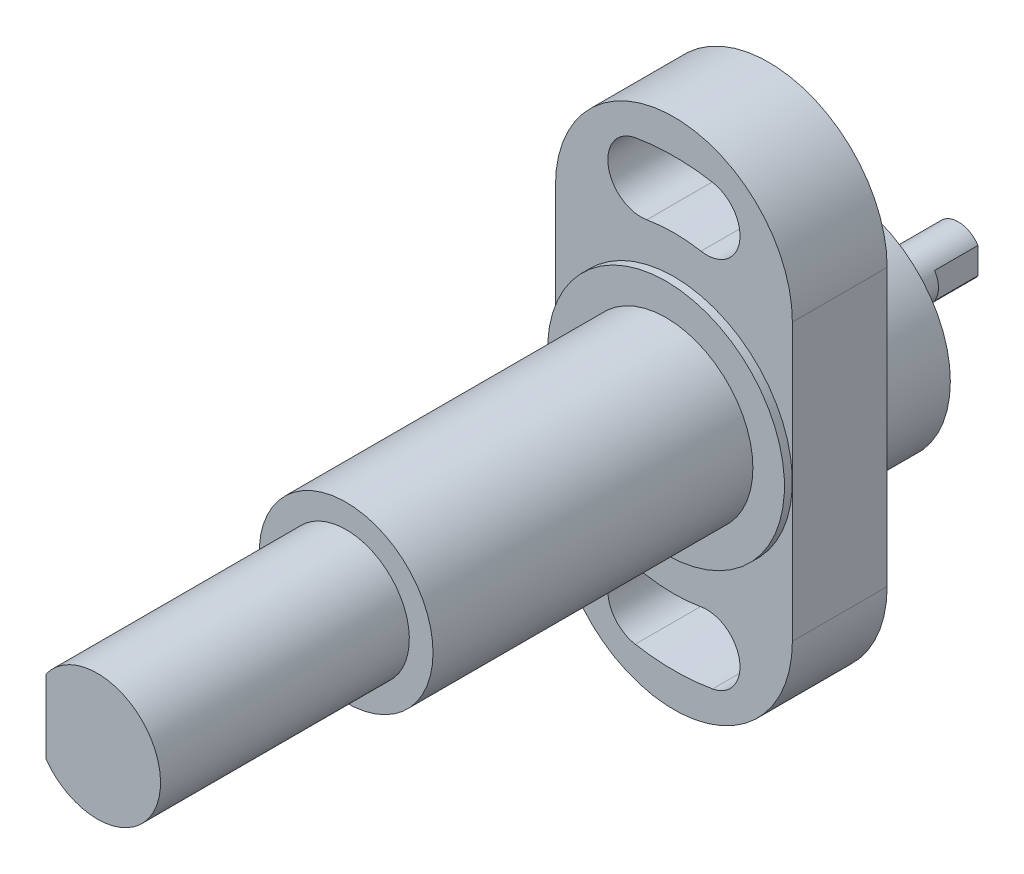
ISO-10303-21;
HEADER;
FILE_DESCRIPTION(('STEP AP214'),'2;1');
FILE_NAME('part.step','',(''),(''),'','','');
FILE_SCHEMA(('AUTOMOTIVE_DESIGN { 1 0 10303 214 1 1 1 1 }'));
ENDSEC;
DATA;
#1=APPLICATION_CONTEXT('core data for automotive mechanical design processes');
#2=APPLICATION_PROTOCOL_DEFINITION('international standard','automotive_design',2000,#1);
#3=PRODUCT_CONTEXT('',#1,'mechanical');
#4=PRODUCT('Part','Part','',(#3));
#5=PRODUCT_RELATED_PRODUCT_CATEGORY('part','',(#4));
#6=PRODUCT_DEFINITION_FORMATION('','',#4);
#7=PRODUCT_DEFINITION_CONTEXT('part definition',#1,'design');
#8=PRODUCT_DEFINITION('design','',#6,#7);
#9=PRODUCT_DEFINITION_SHAPE('','',#8);
#10=(LENGTH_UNIT() NAMED_UNIT(*) SI_UNIT(.MILLI.,.METRE.));
#11=(NAMED_UNIT(*) PLANE_ANGLE_UNIT() SI_UNIT($,.RADIAN.));
#12=(NAMED_UNIT(*) SI_UNIT($,.STERADIAN.) SOLID_ANGLE_UNIT());
#13=UNCERTAINTY_MEASURE_WITH_UNIT(LENGTH_MEASURE(1.E-05),#10,'distance_accuracy_value','');
#14=(GEOMETRIC_REPRESENTATION_CONTEXT(3) GLOBAL_UNCERTAINTY_ASSIGNED_CONTEXT((#13)) GLOBAL_UNIT_ASSIGNED_CONTEXT((#10,
#11,#12)) REPRESENTATION_CONTEXT('',''));
#15=CARTESIAN_POINT('',(0.,0.,0.));
#16=DIRECTION('',(0.,0.,1.));
#17=DIRECTION('',(1.,0.,0.));
#18=AXIS2_PLACEMENT_3D('',#15,#16,#17);
#19=CARTESIAN_POINT('',(-8.,0.,-21.));
#20=DIRECTION('',(0.,0.,-1.));
#21=DIRECTION('',(0.,-1.,0.));
#22=AXIS2_PLACEMENT_3D('',#19,#20,#21);
#23=PLANE('',#22);
#24=CARTESIAN_POINT('',(0.,0.,-21.));
#25=DIRECTION('',(0.,0.,-1.));
#26=DIRECTION('',(0.,-1.,0.));
#27=AXIS2_PLACEMENT_3D('',#24,#25,#26);
#28=CIRCLE('',#27,14.);
#29=CARTESIAN_POINT('',(0.,-14.,-21.));
#30=VERTEX_POINT('',#29);
#31=EDGE_CURVE('E254',#30,#30,#28,.T.);
#32=ORIENTED_EDGE('',*,*,#31,.T.);
#33=EDGE_LOOP('',(#32));
#34=FACE_BOUND('',#33,.T.);
#35=CARTESIAN_POINT('',(0.,0.,-21.));
#36=DIRECTION('',(0.,0.,-1.));
#37=DIRECTION('',(-1.,0.,0.));
#38=AXIS2_PLACEMENT_3D('',#35,#36,#37);
#39=CIRCLE('',#38,3.);
#40=CARTESIAN_POINT('',(-3.,0.,-21.));
#41=VERTEX_POINT('',#40);
#42=EDGE_CURVE('E183',#41,#41,#39,.T.);
#43=ORIENTED_EDGE('',*,*,#42,.F.);
#44=EDGE_LOOP('',(#43));
#45=FACE_BOUND('',#44,.T.);
#46=ADVANCED_FACE('F14',(#34,#45),#23,.T.);
#47=CARTESIAN_POINT('',(0.,0.,-21.));
#48=DIRECTION('',(0.,0.,1.));
#49=DIRECTION('',(0.,1.,0.));
#50=AXIS2_PLACEMENT_3D('',#47,#48,#49);
#51=CYLINDRICAL_SURFACE('',#50,28.2);
#52=DIRECTION('',(0.,0.,1.));
#53=VECTOR('',#52,1.);
#54=CARTESIAN_POINT('',(4.89687861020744,-27.7715786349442,-21.));
#55=LINE('',#54,#53);
#56=CARTESIAN_POINT('',(4.89687861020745,-27.7715786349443,-12.));
#57=VERTEX_POINT('',#56);
#58=CARTESIAN_POINT('',(4.89687861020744,-27.7715786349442,0.));
#59=VERTEX_POINT('',#58);
#60=EDGE_CURVE('E252',#57,#59,#55,.T.);
#61=ORIENTED_EDGE('',*,*,#60,.F.);
#62=CARTESIAN_POINT('',(0.,0.,-12.));
#63=DIRECTION('',(0.,0.,-1.));
#64=DIRECTION('',(-1.,0.,0.));
#65=AXIS2_PLACEMENT_3D('',#62,#63,#64);
#66=CIRCLE('',#65,28.2);
#67=CARTESIAN_POINT('',(-4.89687861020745,-27.7715786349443,-12.));
#68=VERTEX_POINT('',#67);
#69=EDGE_CURVE('E189',#57,#68,#66,.T.);
#70=ORIENTED_EDGE('',*,*,#69,.T.);
#71=DIRECTION('',(0.,0.,1.));
#72=VECTOR('',#71,1.);
#73=CARTESIAN_POINT('',(-4.89687861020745,-27.7715786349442,-21.));
#74=LINE('',#73,#72);
#75=CARTESIAN_POINT('',(-4.89687861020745,-27.7715786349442,0.));
#76=VERTEX_POINT('',#75);
#77=EDGE_CURVE('E255',#68,#76,#74,.T.);
#78=ORIENTED_EDGE('',*,*,#77,.T.);
#79=CARTESIAN_POINT('',(0.,0.,0.));
#80=DIRECTION('',(0.,0.,-1.));
#81=DIRECTION('',(0.,-1.,0.));
#82=AXIS2_PLACEMENT_3D('',#79,#80,#81);
#83=CIRCLE('',#82,28.2);
#84=EDGE_CURVE('E319',#59,#76,#83,.T.);
#85=ORIENTED_EDGE('',*,*,#84,.F.);
#86=EDGE_LOOP('',(#61,#70,#78,#85));
#87=FACE_BOUND('',#86,.T.);
#88=ADVANCED_FACE('F373',(#87),#51,.F.);
#89=CARTESIAN_POINT('',(-4.16755626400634,-23.635386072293,-21.));
#90=DIRECTION('',(0.,0.,1.));
#91=DIRECTION('',(0.,1.,0.));
#92=AXIS2_PLACEMENT_3D('',#89,#90,#91);
#93=CYLINDRICAL_SURFACE('',#92,4.2);
#94=ORIENTED_EDGE('',*,*,#77,.F.);
#95=CARTESIAN_POINT('',(-4.16755626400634,-23.635386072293,-12.));
#96=DIRECTION('',(0.,0.,-1.));
#97=DIRECTION('',(-1.,0.,0.));
#98=AXIS2_PLACEMENT_3D('',#95,#96,#97);
#99=CIRCLE('',#98,4.2);
#100=CARTESIAN_POINT('',(-3.43823391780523,-19.4991935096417,-12.));
#101=VERTEX_POINT('',#100);
#102=EDGE_CURVE('E194',#68,#101,#99,.T.);
#103=ORIENTED_EDGE('',*,*,#102,.T.);
#104=DIRECTION('',(0.,0.,1.));
#105=VECTOR('',#104,1.);
#106=CARTESIAN_POINT('',(-3.43823391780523,-19.4991935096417,-21.));
#107=LINE('',#106,#105);
#108=CARTESIAN_POINT('',(-3.43823391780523,-19.4991935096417,0.));
#109=VERTEX_POINT('',#108);
#110=EDGE_CURVE('E257',#101,#109,#107,.T.);
#111=ORIENTED_EDGE('',*,*,#110,.T.);
#112=CARTESIAN_POINT('',(-4.16755626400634,-23.635386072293,0.));
#113=DIRECTION('',(0.,0.,-1.));
#114=DIRECTION('',(0.,-1.,0.));
#115=AXIS2_PLACEMENT_3D('',#112,#113,#114);
#116=CIRCLE('',#115,4.2);
#117=EDGE_CURVE('E316',#76,#109,#116,.T.);
#118=ORIENTED_EDGE('',*,*,#117,.F.);
#119=EDGE_LOOP('',(#94,#103,#111,#118));
#120=FACE_BOUND('',#119,.T.);
#121=ADVANCED_FACE('F380',(#120),#93,.F.);
#122=CARTESIAN_POINT('',(0.,0.,-21.));
#123=DIRECTION('',(0.,0.,1.));
#124=DIRECTION('',(0.,1.,0.));
#125=AXIS2_PLACEMENT_3D('',#122,#123,#124);
#126=CYLINDRICAL_SURFACE('',#125,19.8);
#127=ORIENTED_EDGE('',*,*,#110,.F.);
#128=CARTESIAN_POINT('',(0.,0.,-12.));
#129=DIRECTION('',(0.,0.,1.));
#130=DIRECTION('',(-1.,0.,0.));
#131=AXIS2_PLACEMENT_3D('',#128,#129,#130);
#132=CIRCLE('',#131,19.8);
#133=CARTESIAN_POINT('',(3.43823391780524,-19.4991935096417,-12.));
#134=VERTEX_POINT('',#133);
#135=EDGE_CURVE('E197',#101,#134,#132,.T.);
#136=ORIENTED_EDGE('',*,*,#135,.T.);
#137=DIRECTION('',(0.,0.,1.));
#138=VECTOR('',#137,1.);
#139=CARTESIAN_POINT('',(3.43823391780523,-19.4991935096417,-21.));
#140=LINE('',#139,#138);
#141=CARTESIAN_POINT('',(3.43823391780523,-19.4991935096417,0.));
#142=VERTEX_POINT('',#141);
#143=EDGE_CURVE('E246',#134,#142,#140,.T.);
#144=ORIENTED_EDGE('',*,*,#143,.T.);
#145=CARTESIAN_POINT('',(0.,0.,0.));
#146=DIRECTION('',(0.,0.,-1.));
#147=DIRECTION('',(0.,-1.,0.));
#148=AXIS2_PLACEMENT_3D('',#145,#146,#147);
#149=CIRCLE('',#148,19.8);
#150=EDGE_CURVE('E313',#109,#142,#149,.F.);
#151=ORIENTED_EDGE('',*,*,#150,.F.);
#152=EDGE_LOOP('',(#127,#136,#144,#151));
#153=FACE_BOUND('',#152,.T.);
#154=ADVANCED_FACE('F541',(#153),#126,.T.);
#155=CARTESIAN_POINT('',(4.16755626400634,-23.635386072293,-21.));
#156=DIRECTION('',(0.,0.,1.));
#157=DIRECTION('',(0.,1.,0.));
#158=AXIS2_PLACEMENT_3D('',#155,#156,#157);
#159=CYLINDRICAL_SURFACE('',#158,4.2);
#160=ORIENTED_EDGE('',*,*,#143,.F.);
#161=CARTESIAN_POINT('',(4.16755626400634,-23.635386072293,-12.));
#162=DIRECTION('',(0.,0.,-1.));
#163=DIRECTION('',(-1.,0.,0.));
#164=AXIS2_PLACEMENT_3D('',#161,#162,#163);
#165=CIRCLE('',#164,4.2);
#166=EDGE_CURVE('E200',#134,#57,#165,.T.);
#167=ORIENTED_EDGE('',*,*,#166,.T.);
#168=ORIENTED_EDGE('',*,*,#60,.T.);
#169=CARTESIAN_POINT('',(4.16755626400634,-23.635386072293,0.));
#170=DIRECTION('',(0.,0.,-1.));
#171=DIRECTION('',(0.,-1.,0.));
#172=AXIS2_PLACEMENT_3D('',#169,#170,#171);
#173=CIRCLE('',#172,4.2);
#174=EDGE_CURVE('E322',#142,#59,#173,.T.);
#175=ORIENTED_EDGE('',*,*,#174,.F.);
#176=EDGE_LOOP('',(#160,#167,#168,#175));
#177=FACE_BOUND('',#176,.T.);
#178=ADVANCED_FACE('F527',(#177),#159,.F.);
#179=CARTESIAN_POINT('',(0.,0.,-21.));
#180=DIRECTION('',(0.,0.,1.));
#181=DIRECTION('',(0.,1.,0.));
#182=AXIS2_PLACEMENT_3D('',#179,#180,#181);
#183=CYLINDRICAL_SURFACE('',#182,28.2);
#184=DIRECTION('',(0.,0.,1.));
#185=VECTOR('',#184,1.);
#186=CARTESIAN_POINT('',(-4.89687861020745,27.7715786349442,-21.));
#187=LINE('',#186,#185);
#188=CARTESIAN_POINT('',(-4.89687861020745,27.7715786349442,-12.));
#189=VERTEX_POINT('',#188);
#190=CARTESIAN_POINT('',(-4.89687861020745,27.7715786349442,0.));
#191=VERTEX_POINT('',#190);
#192=EDGE_CURVE('E244',#189,#191,#187,.T.);
#193=ORIENTED_EDGE('',*,*,#192,.F.);
#194=CARTESIAN_POINT('',(0.,0.,-12.));
#195=DIRECTION('',(0.,0.,-1.));
#196=DIRECTION('',(-1.,0.,0.));
#197=AXIS2_PLACEMENT_3D('',#194,#195,#196);
#198=CIRCLE('',#197,28.2);
#199=CARTESIAN_POINT('',(4.89687861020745,27.7715786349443,-12.));
#200=VERTEX_POINT('',#199);
#201=EDGE_CURVE('E206',#189,#200,#198,.T.);
#202=ORIENTED_EDGE('',*,*,#201,.T.);
#203=DIRECTION('',(0.,0.,1.));
#204=VECTOR('',#203,1.);
#205=CARTESIAN_POINT('',(4.89687861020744,27.7715786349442,-21.));
#206=LINE('',#205,#204);
#207=CARTESIAN_POINT('',(4.89687861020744,27.7715786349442,0.));
#208=VERTEX_POINT('',#207);
#209=EDGE_CURVE('E247',#200,#208,#206,.T.);
#210=ORIENTED_EDGE('',*,*,#209,.T.);
#211=CARTESIAN_POINT('',(0.,0.,0.));
#212=DIRECTION('',(0.,0.,-1.));
#213=DIRECTION('',(0.,-1.,0.));
#214=AXIS2_PLACEMENT_3D('',#211,#212,#213);
#215=CIRCLE('',#214,28.2);
#216=EDGE_CURVE('E23',#191,#208,#215,.T.);
#217=ORIENTED_EDGE('',*,*,#216,.F.);
#218=EDGE_LOOP('',(#193,#202,#210,#217));
#219=FACE_BOUND('',#218,.T.);
#220=ADVANCED_FACE('F523',(#219),#183,.F.);
#221=CARTESIAN_POINT('',(4.16755626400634,23.635386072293,-21.));
#222=DIRECTION('',(0.,0.,1.));
#223=DIRECTION('',(0.,1.,0.));
#224=AXIS2_PLACEMENT_3D('',#221,#222,#223);
#225=CYLINDRICAL_SURFACE('',#224,4.2);
#226=ORIENTED_EDGE('',*,*,#209,.F.);
#227=CARTESIAN_POINT('',(4.16755626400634,23.635386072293,-12.));
#228=DIRECTION('',(0.,0.,-1.));
#229=DIRECTION('',(-1.,0.,0.));
#230=AXIS2_PLACEMENT_3D('',#227,#228,#229);
#231=CIRCLE('',#230,4.2);
#232=CARTESIAN_POINT('',(3.43823391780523,19.4991935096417,-12.));
#233=VERTEX_POINT('',#232);
#234=EDGE_CURVE('E209',#200,#233,#231,.T.);
#235=ORIENTED_EDGE('',*,*,#234,.T.);
#236=DIRECTION('',(0.,0.,1.));
#237=VECTOR('',#236,1.);
#238=CARTESIAN_POINT('',(3.43823391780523,19.4991935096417,-21.));
#239=LINE('',#238,#237);
#240=CARTESIAN_POINT('',(3.43823391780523,19.4991935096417,0.));
#241=VERTEX_POINT('',#240);
#242=EDGE_CURVE('E249',#233,#241,#239,.T.);
#243=ORIENTED_EDGE('',*,*,#242,.T.);
#244=CARTESIAN_POINT('',(4.16755626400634,23.635386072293,0.));
#245=DIRECTION('',(0.,0.,-1.));
#246=DIRECTION('',(0.,-1.,0.));
#247=AXIS2_PLACEMENT_3D('',#244,#245,#246);
#248=CIRCLE('',#247,4.2);
#249=EDGE_CURVE('E328',#208,#241,#248,.T.);
#250=ORIENTED_EDGE('',*,*,#249,.F.);
#251=EDGE_LOOP('',(#226,#235,#243,#250));
#252=FACE_BOUND('',#251,.T.);
#253=ADVANCED_FACE('F526',(#252),#225,.F.);
#254=CARTESIAN_POINT('',(0.,0.,-21.));
#255=DIRECTION('',(0.,0.,1.));
#256=DIRECTION('',(0.,1.,0.));
#257=AXIS2_PLACEMENT_3D('',#254,#255,#256);
#258=CYLINDRICAL_SURFACE('',#257,19.8);
#259=ORIENTED_EDGE('',*,*,#242,.F.);
#260=CARTESIAN_POINT('',(0.,0.,-12.));
#261=DIRECTION('',(0.,0.,1.));
#262=DIRECTION('',(-1.,0.,0.));
#263=AXIS2_PLACEMENT_3D('',#260,#261,#262);
#264=CIRCLE('',#263,19.8);
#265=CARTESIAN_POINT('',(-3.43823391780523,19.4991935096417,-12.));
#266=VERTEX_POINT('',#265);
#267=EDGE_CURVE('E212',#233,#266,#264,.T.);
#268=ORIENTED_EDGE('',*,*,#267,.T.);
#269=DIRECTION('',(0.,0.,1.));
#270=VECTOR('',#269,1.);
#271=CARTESIAN_POINT('',(-3.43823391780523,19.4991935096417,-21.));
#272=LINE('',#271,#270);
#273=CARTESIAN_POINT('',(-3.43823391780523,19.4991935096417,0.));
#274=VERTEX_POINT('',#273);
#275=EDGE_CURVE('E243',#266,#274,#272,.T.);
#276=ORIENTED_EDGE('',*,*,#275,.T.);
#277=CARTESIAN_POINT('',(0.,0.,0.));
#278=DIRECTION('',(0.,0.,-1.));
#279=DIRECTION('',(0.,-1.,0.));
#280=AXIS2_PLACEMENT_3D('',#277,#278,#279);
#281=CIRCLE('',#280,19.8);
#282=EDGE_CURVE('E325',#241,#274,#281,.F.);
#283=ORIENTED_EDGE('',*,*,#282,.F.);
#284=EDGE_LOOP('',(#259,#268,#276,#283));
#285=FACE_BOUND('',#284,.T.);
#286=ADVANCED_FACE('F531',(#285),#258,.T.);
#287=CARTESIAN_POINT('',(-4.16755626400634,23.635386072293,-21.));
#288=DIRECTION('',(0.,0.,1.));
#289=DIRECTION('',(0.,1.,0.));
#290=AXIS2_PLACEMENT_3D('',#287,#288,#289);
#291=CYLINDRICAL_SURFACE('',#290,4.2);
#292=ORIENTED_EDGE('',*,*,#275,.F.);
#293=CARTESIAN_POINT('',(-4.16755626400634,23.635386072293,-12.));
#294=DIRECTION('',(0.,0.,-1.));
#295=DIRECTION('',(-1.,0.,0.));
#296=AXIS2_PLACEMENT_3D('',#293,#294,#295);
#297=CIRCLE('',#296,4.2);
#298=EDGE_CURVE('E203',#266,#189,#297,.T.);
#299=ORIENTED_EDGE('',*,*,#298,.T.);
#300=ORIENTED_EDGE('',*,*,#192,.T.);
#301=CARTESIAN_POINT('',(-4.16755626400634,23.635386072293,0.));
#302=DIRECTION('',(0.,0.,-1.));
#303=DIRECTION('',(0.,-1.,0.));
#304=AXIS2_PLACEMENT_3D('',#301,#302,#303);
#305=CIRCLE('',#304,4.2);
#306=EDGE_CURVE('E9',#274,#191,#305,.T.);
#307=ORIENTED_EDGE('',*,*,#306,.F.);
#308=EDGE_LOOP('',(#292,#299,#300,#307));
#309=FACE_BOUND('',#308,.T.);
#310=ADVANCED_FACE('F448',(#309),#291,.F.);
#311=CARTESIAN_POINT('',(-11.,0.,1.));
#312=DIRECTION('',(0.,0.,1.));
#313=DIRECTION('',(0.,1.,0.));
#314=AXIS2_PLACEMENT_3D('',#311,#312,#313);
#315=PLANE('',#314);
#316=CARTESIAN_POINT('',(0.,0.,1.));
#317=DIRECTION('',(0.,0.,1.));
#318=DIRECTION('',(0.,1.,0.));
#319=AXIS2_PLACEMENT_3D('',#316,#317,#318);
#320=CIRCLE('',#319,11.);
#321=CARTESIAN_POINT('',(0.,11.,1.));
#322=VERTEX_POINT('',#321);
#323=EDGE_CURVE('E299',#322,#322,#320,.F.);
#324=ORIENTED_EDGE('',*,*,#323,.T.);
#325=EDGE_LOOP('',(#324));
#326=FACE_BOUND('',#325,.T.);
#327=CARTESIAN_POINT('',(0.,0.,1.));
#328=DIRECTION('',(0.,0.,-1.));
#329=DIRECTION('',(0.,-1.,0.));
#330=AXIS2_PLACEMENT_3D('',#327,#328,#329);
#331=CIRCLE('',#330,14.995);
#332=CARTESIAN_POINT('',(0.,-14.995,1.));
#333=VERTEX_POINT('',#332);
#334=EDGE_CURVE('E296',#333,#333,#331,.T.);
#335=ORIENTED_EDGE('',*,*,#334,.F.);
#336=EDGE_LOOP('',(#335));
#337=FACE_BOUND('',#336,.T.);
#338=ADVANCED_FACE('F445',(#326,#337),#315,.T.);
#339=CARTESIAN_POINT('',(-15.,10.,-6.));
#340=DIRECTION('',(-1.,0.,0.));
#341=DIRECTION('',(0.,-1.,0.));
#342=AXIS2_PLACEMENT_3D('',#339,#340,#341);
#343=CONICAL_SURFACE('',#342,2.65,0.78539816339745);
#344=CARTESIAN_POINT('',(-14.85,10.,-6.));
#345=DIRECTION('',(-1.,0.,0.));
#346=DIRECTION('',(0.,0.,1.));
#347=AXIS2_PLACEMENT_3D('',#344,#345,#346);
#348=CIRCLE('',#347,2.5);
#349=CARTESIAN_POINT('',(-14.85,10.,-3.5));
#350=VERTEX_POINT('',#349);
#351=EDGE_CURVE('E341',#350,#350,#348,.F.);
#352=ORIENTED_EDGE('',*,*,#351,.T.);
#353=EDGE_LOOP('',(#352));
#354=FACE_BOUND('',#353,.T.);
#355=CARTESIAN_POINT('',(-15.,10.,-6.));
#356=DIRECTION('',(-1.,0.,0.));
#357=DIRECTION('',(0.,-1.,0.));
#358=AXIS2_PLACEMENT_3D('',#355,#356,#357);
#359=CIRCLE('',#358,2.65);
#360=CARTESIAN_POINT('',(-15.,7.35,-6.));
#361=VERTEX_POINT('',#360);
#362=EDGE_CURVE('E233',#361,#361,#359,.T.);
#363=ORIENTED_EDGE('',*,*,#362,.T.);
#364=EDGE_LOOP('',(#363));
#365=FACE_BOUND('',#364,.T.);
#366=ADVANCED_FACE('F443',(#354,#365),#343,.F.);
#367=CARTESIAN_POINT('',(0.,0.,-12.));
#368=DIRECTION('',(0.,0.,-1.));
#369=DIRECTION('',(0.,-1.,0.));
#370=AXIS2_PLACEMENT_3D('',#367,#368,#369);
#371=CYLINDRICAL_SURFACE('',#370,14.995);
#372=ORIENTED_EDGE('',*,*,#334,.T.);
#373=EDGE_LOOP('',(#372));
#374=FACE_BOUND('',#373,.T.);
#375=CARTESIAN_POINT('',(0.,0.,0.));
#376=DIRECTION('',(0.,0.,1.));
#377=DIRECTION('',(0.,1.,0.));
#378=AXIS2_PLACEMENT_3D('',#375,#376,#377);
#379=CIRCLE('',#378,14.995);
#380=CARTESIAN_POINT('',(0.,14.995,0.));
#381=VERTEX_POINT('',#380);
#382=EDGE_CURVE('E276',#381,#381,#379,.T.);
#383=ORIENTED_EDGE('',*,*,#382,.T.);
#384=EDGE_LOOP('',(#383));
#385=FACE_BOUND('',#384,.T.);
#386=ADVANCED_FACE('F429',(#374,#385),#371,.T.);
#387=CARTESIAN_POINT('',(15.,-17.5,0.));
#388=DIRECTION('',(-1.,0.,0.));
#389=DIRECTION('',(0.,-1.,0.));
#390=AXIS2_PLACEMENT_3D('',#387,#388,#389);
#391=PLANE('',#390);
#392=DIRECTION('',(0.,-1.,0.));
#393=VECTOR('',#392,1.);
#394=CARTESIAN_POINT('',(15.,17.5,-12.));
#395=LINE('',#394,#393);
#396=CARTESIAN_POINT('',(15.,17.5,-12.));
#397=VERTEX_POINT('',#396);
#398=CARTESIAN_POINT('',(15.,-17.5,-12.));
#399=VERTEX_POINT('',#398);
#400=EDGE_CURVE('E221',#397,#399,#395,.T.);
#401=ORIENTED_EDGE('',*,*,#400,.F.);
#402=DIRECTION('',(0.,0.,-1.));
#403=VECTOR('',#402,1.);
#404=CARTESIAN_POINT('',(15.,17.5,0.));
#405=LINE('',#404,#403);
#406=CARTESIAN_POINT('',(15.,17.5,0.));
#407=VERTEX_POINT('',#406);
#408=EDGE_CURVE('E288',#407,#397,#405,.T.);
#409=ORIENTED_EDGE('',*,*,#408,.F.);
#410=DIRECTION('',(0.,1.,0.));
#411=VECTOR('',#410,1.);
#412=CARTESIAN_POINT('',(15.,-17.5,0.));
#413=LINE('',#412,#411);
#414=CARTESIAN_POINT('',(15.,-17.5,0.));
#415=VERTEX_POINT('',#414);
#416=EDGE_CURVE('E286',#415,#407,#413,.T.);
#417=ORIENTED_EDGE('',*,*,#416,.F.);
#418=DIRECTION('',(0.,0.,-1.));
#419=VECTOR('',#418,1.);
#420=CARTESIAN_POINT('',(15.,-17.5,0.));
#421=LINE('',#420,#419);
#422=EDGE_CURVE('E290',#415,#399,#421,.T.);
#423=ORIENTED_EDGE('',*,*,#422,.T.);
#424=EDGE_LOOP('',(#401,#409,#417,#423));
#425=FACE_BOUND('',#424,.T.);
#426=ADVANCED_FACE('F425',(#425),#391,.F.);
#427=CARTESIAN_POINT('',(0.,17.5,0.));
#428=DIRECTION('',(0.,0.,-1.));
#429=DIRECTION('',(0.,-1.,0.));
#430=AXIS2_PLACEMENT_3D('',#427,#428,#429);
#431=CYLINDRICAL_SURFACE('',#430,15.);
#432=CARTESIAN_POINT('',(0.,17.5,-12.));
#433=DIRECTION('',(0.,0.,-1.));
#434=DIRECTION('',(-1.,0.,0.));
#435=AXIS2_PLACEMENT_3D('',#432,#433,#434);
#436=CIRCLE('',#435,15.);
#437=CARTESIAN_POINT('',(-15.,17.5,-12.));
#438=VERTEX_POINT('',#437);
#439=EDGE_CURVE('E218',#438,#397,#436,.T.);
#440=ORIENTED_EDGE('',*,*,#439,.F.);
#441=DIRECTION('',(0.,0.,-1.));
#442=VECTOR('',#441,1.);
#443=CARTESIAN_POINT('',(-15.,17.5,0.));
#444=LINE('',#443,#442);
#445=CARTESIAN_POINT('',(-15.,17.5,0.));
#446=VERTEX_POINT('',#445);
#447=EDGE_CURVE('E294',#446,#438,#444,.T.);
#448=ORIENTED_EDGE('',*,*,#447,.F.);
#449=CARTESIAN_POINT('',(0.,17.5,0.));
#450=DIRECTION('',(0.,0.,1.));
#451=DIRECTION('',(0.,-1.,0.));
#452=AXIS2_PLACEMENT_3D('',#449,#450,#451);
#453=CIRCLE('',#452,15.);
#454=EDGE_CURVE('E279',#407,#446,#453,.T.);
#455=ORIENTED_EDGE('',*,*,#454,.F.);
#456=ORIENTED_EDGE('',*,*,#408,.T.);
#457=EDGE_LOOP('',(#440,#448,#455,#456));
#458=FACE_BOUND('',#457,.T.);
#459=ADVANCED_FACE('F428',(#458),#431,.T.);
#460=CARTESIAN_POINT('',(-15.,-17.5,0.));
#461=DIRECTION('',(1.,0.,0.));
#462=DIRECTION('',(0.,1.,0.));
#463=AXIS2_PLACEMENT_3D('',#460,#461,#462);
#464=PLANE('',#463);
#465=DIRECTION('',(0.,1.,0.));
#466=VECTOR('',#465,1.);
#467=CARTESIAN_POINT('',(-15.,-17.5,-12.));
#468=LINE('',#467,#466);
#469=CARTESIAN_POINT('',(-15.,-17.5,-12.));
#470=VERTEX_POINT('',#469);
#471=EDGE_CURVE('E227',#470,#438,#468,.T.);
#472=ORIENTED_EDGE('',*,*,#471,.F.);
#473=DIRECTION('',(0.,0.,-1.));
#474=VECTOR('',#473,1.);
#475=CARTESIAN_POINT('',(-15.,-17.5,0.));
#476=LINE('',#475,#474);
#477=CARTESIAN_POINT('',(-15.,-17.5,0.));
#478=VERTEX_POINT('',#477);
#479=EDGE_CURVE('E292',#478,#470,#476,.T.);
#480=ORIENTED_EDGE('',*,*,#479,.F.);
#481=DIRECTION('',(0.,-1.,0.));
#482=VECTOR('',#481,1.);
#483=CARTESIAN_POINT('',(-15.,-17.5,0.));
#484=LINE('',#483,#482);
#485=EDGE_CURVE('E282',#446,#478,#484,.T.);
#486=ORIENTED_EDGE('',*,*,#485,.F.);
#487=ORIENTED_EDGE('',*,*,#447,.T.);
#488=EDGE_LOOP('',(#472,#480,#486,#487));
#489=FACE_BOUND('',#488,.T.);
#490=ORIENTED_EDGE('',*,*,#362,.F.);
#491=EDGE_LOOP('',(#490));
#492=FACE_BOUND('',#491,.T.);
#493=ADVANCED_FACE('F433',(#489,#492),#464,.F.);
#494=CARTESIAN_POINT('',(0.,-17.5,0.));
#495=DIRECTION('',(0.,0.,-1.));
#496=DIRECTION('',(0.,-1.,0.));
#497=AXIS2_PLACEMENT_3D('',#494,#495,#496);
#498=CYLINDRICAL_SURFACE('',#497,15.);
#499=CARTESIAN_POINT('',(0.,-17.5,-12.));
#500=DIRECTION('',(0.,0.,-1.));
#501=DIRECTION('',(-1.,0.,0.));
#502=AXIS2_PLACEMENT_3D('',#499,#500,#501);
#503=CIRCLE('',#502,15.);
#504=EDGE_CURVE('E224',#399,#470,#503,.T.);
#505=ORIENTED_EDGE('',*,*,#504,.F.);
#506=ORIENTED_EDGE('',*,*,#422,.F.);
#507=CARTESIAN_POINT('',(0.,-17.5,0.));
#508=DIRECTION('',(0.,0.,1.));
#509=DIRECTION('',(0.,1.,0.));
#510=AXIS2_PLACEMENT_3D('',#507,#508,#509);
#511=CIRCLE('',#510,15.);
#512=EDGE_CURVE('E284',#478,#415,#511,.T.);
#513=ORIENTED_EDGE('',*,*,#512,.F.);
#514=ORIENTED_EDGE('',*,*,#479,.T.);
#515=EDGE_LOOP('',(#505,#506,#513,#514));
#516=FACE_BOUND('',#515,.T.);
#517=ADVANCED_FACE('F423',(#516),#498,.T.);
#518=CARTESIAN_POINT('',(0.,17.5,0.));
#519=DIRECTION('',(0.,0.,-1.));
#520=DIRECTION('',(0.,-1.,0.));
#521=AXIS2_PLACEMENT_3D('',#518,#519,#520);
#522=PLANE('',#521);
#523=ORIENTED_EDGE('',*,*,#282,.T.);
#524=ORIENTED_EDGE('',*,*,#306,.T.);
#525=ORIENTED_EDGE('',*,*,#216,.T.);
#526=ORIENTED_EDGE('',*,*,#249,.T.);
#527=EDGE_LOOP('',(#523,#524,#525,#526));
#528=FACE_BOUND('',#527,.T.);
#529=ORIENTED_EDGE('',*,*,#150,.T.);
#530=ORIENTED_EDGE('',*,*,#174,.T.);
#531=ORIENTED_EDGE('',*,*,#84,.T.);
#532=ORIENTED_EDGE('',*,*,#117,.T.);
#533=EDGE_LOOP('',(#529,#530,#531,#532));
#534=FACE_BOUND('',#533,.T.);
#535=ORIENTED_EDGE('',*,*,#454,.T.);
#536=ORIENTED_EDGE('',*,*,#485,.T.);
#537=ORIENTED_EDGE('',*,*,#512,.T.);
#538=ORIENTED_EDGE('',*,*,#416,.T.);
#539=EDGE_LOOP('',(#535,#536,#537,#538));
#540=FACE_BOUND('',#539,.T.);
#541=ORIENTED_EDGE('',*,*,#382,.F.);
#542=EDGE_LOOP('',(#541));
#543=FACE_BOUND('',#542,.T.);
#544=ADVANCED_FACE('F420',(#528,#534,#540,#543),#522,.F.);
#545=CARTESIAN_POINT('',(0.,0.,-12.));
#546=DIRECTION('',(0.,0.,-1.));
#547=DIRECTION('',(0.,-1.,0.));
#548=AXIS2_PLACEMENT_3D('',#545,#546,#547);
#549=CYLINDRICAL_SURFACE('',#548,14.);
#550=CARTESIAN_POINT('',(0.,0.,-12.));
#551=DIRECTION('',(0.,0.,-1.));
#552=DIRECTION('',(0.,-1.,0.));
#553=AXIS2_PLACEMENT_3D('',#550,#551,#552);
#554=CIRCLE('',#553,14.);
#555=CARTESIAN_POINT('',(0.,-14.,-12.));
#556=VERTEX_POINT('',#555);
#557=EDGE_CURVE('E310',#556,#556,#554,.T.);
#558=ORIENTED_EDGE('',*,*,#557,.T.);
#559=EDGE_LOOP('',(#558));
#560=FACE_BOUND('',#559,.T.);
#561=ORIENTED_EDGE('',*,*,#31,.F.);
#562=EDGE_LOOP('',(#561));
#563=FACE_BOUND('',#562,.T.);
#564=ADVANCED_FACE('F386',(#560,#563),#549,.T.);
#565=CARTESIAN_POINT('',(-8.,0.,-12.));
#566=DIRECTION('',(0.,0.,-1.));
#567=DIRECTION('',(0.,-1.,0.));
#568=AXIS2_PLACEMENT_3D('',#565,#566,#567);
#569=PLANE('',#568);
#570=ORIENTED_EDGE('',*,*,#69,.F.);
#571=ORIENTED_EDGE('',*,*,#166,.F.);
#572=ORIENTED_EDGE('',*,*,#135,.F.);
#573=ORIENTED_EDGE('',*,*,#102,.F.);
#574=EDGE_LOOP('',(#570,#571,#572,#573));
#575=FACE_BOUND('',#574,.T.);
#576=ORIENTED_EDGE('',*,*,#298,.F.);
#577=ORIENTED_EDGE('',*,*,#267,.F.);
#578=ORIENTED_EDGE('',*,*,#234,.F.);
#579=ORIENTED_EDGE('',*,*,#201,.F.);
#580=EDGE_LOOP('',(#576,#577,#578,#579));
#581=FACE_BOUND('',#580,.T.);
#582=ORIENTED_EDGE('',*,*,#557,.F.);
#583=EDGE_LOOP('',(#582));
#584=FACE_BOUND('',#583,.T.);
#585=ORIENTED_EDGE('',*,*,#439,.T.);
#586=ORIENTED_EDGE('',*,*,#400,.T.);
#587=ORIENTED_EDGE('',*,*,#504,.T.);
#588=ORIENTED_EDGE('',*,*,#471,.T.);
#589=EDGE_LOOP('',(#585,#586,#587,#588));
#590=FACE_BOUND('',#589,.T.);
#591=ADVANCED_FACE('F16',(#575,#581,#584,#590),#569,.T.);
#592=CARTESIAN_POINT('',(0.,0.,-12.));
#593=DIRECTION('',(0.,0.,-1.));
#594=DIRECTION('',(0.,-1.,0.));
#595=AXIS2_PLACEMENT_3D('',#592,#593,#594);
#596=CYLINDRICAL_SURFACE('',#595,11.);
#597=ORIENTED_EDGE('',*,*,#323,.F.);
#598=EDGE_LOOP('',(#597));
#599=FACE_BOUND('',#598,.T.);
#600=CARTESIAN_POINT('',(0.,0.,41.5));
#601=DIRECTION('',(0.,0.,1.));
#602=DIRECTION('',(1.,0.,0.));
#603=AXIS2_PLACEMENT_3D('',#600,#601,#602);
#604=CIRCLE('',#603,11.);
#605=CARTESIAN_POINT('',(11.,0.,41.5));
#606=VERTEX_POINT('',#605);
#607=EDGE_CURVE('E230',#606,#606,#604,.T.);
#608=ORIENTED_EDGE('',*,*,#607,.F.);
#609=EDGE_LOOP('',(#608));
#610=FACE_BOUND('',#609,.T.);
#611=ADVANCED_FACE('F392',(#599,#610),#596,.T.);
#612=CARTESIAN_POINT('',(-6.5,0.,69.));
#613=DIRECTION('',(-1.,0.,0.));
#614=DIRECTION('',(0.,-1.,0.));
#615=AXIS2_PLACEMENT_3D('',#612,#613,#614);
#616=CONICAL_SURFACE('',#615,2.65,0.785398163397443);
#617=CARTESIAN_POINT('',(-6.35,0.,69.));
#618=DIRECTION('',(-1.,0.,0.));
#619=DIRECTION('',(0.,0.,1.));
#620=AXIS2_PLACEMENT_3D('',#617,#618,#619);
#621=CIRCLE('',#620,2.5);
#622=CARTESIAN_POINT('',(-6.35,0.,71.5));
#623=VERTEX_POINT('',#622);
#624=EDGE_CURVE('E335',#623,#623,#621,.F.);
#625=ORIENTED_EDGE('',*,*,#624,.T.);
#626=EDGE_LOOP('',(#625));
#627=FACE_BOUND('',#626,.T.);
#628=CARTESIAN_POINT('',(-6.5,0.,69.));
#629=DIRECTION('',(-1.,0.,0.));
#630=DIRECTION('',(0.,-1.,0.));
#631=AXIS2_PLACEMENT_3D('',#628,#629,#630);
#632=CIRCLE('',#631,2.65);
#633=CARTESIAN_POINT('',(-6.5,-2.65,69.));
#634=VERTEX_POINT('',#633);
#635=EDGE_CURVE('E262',#634,#634,#632,.T.);
#636=ORIENTED_EDGE('',*,*,#635,.T.);
#637=EDGE_LOOP('',(#636));
#638=FACE_BOUND('',#637,.T.);
#639=ADVANCED_FACE('F388',(#627,#638),#616,.F.);
#640=CARTESIAN_POINT('',(-6.5,-10.,63.));
#641=DIRECTION('',(0.500000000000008,0.,-0.866025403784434));
#642=DIRECTION('',(-0.866025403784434,0.,-0.500000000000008));
#643=AXIS2_PLACEMENT_3D('',#640,#641,#642);
#644=PLANE('',#643);
#645=CARTESIAN_POINT('',(0.,0.,66.7527767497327));
#646=DIRECTION('',(0.500000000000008,0.,-0.866025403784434));
#647=DIRECTION('',(-0.866025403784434,0.,-0.500000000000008));
#648=AXIS2_PLACEMENT_3D('',#645,#646,#647);
#649=ELLIPSE('',#648,9.23760430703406,8.);
#650=CARTESIAN_POINT('',(-6.5,-4.66368952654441,63.));
#651=VERTEX_POINT('',#650);
#652=CARTESIAN_POINT('',(-6.5,4.6636895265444,63.));
#653=VERTEX_POINT('',#652);
#654=EDGE_CURVE('E302',#651,#653,#649,.T.);
#655=ORIENTED_EDGE('',*,*,#654,.F.);
#656=DIRECTION('',(0.,1.,0.));
#657=VECTOR('',#656,1.);
#658=CARTESIAN_POINT('',(-6.5,-10.,63.));
#659=LINE('',#658,#657);
#660=EDGE_CURVE('E268',#651,#653,#659,.T.);
#661=ORIENTED_EDGE('',*,*,#660,.T.);
#662=EDGE_LOOP('',(#655,#661));
#663=FACE_BOUND('',#662,.T.);
#664=ADVANCED_FACE('F391',(#663),#644,.F.);
#665=CARTESIAN_POINT('',(0.,0.,73.));
#666=DIRECTION('',(0.,0.,1.));
#667=DIRECTION('',(0.,1.,0.));
#668=AXIS2_PLACEMENT_3D('',#665,#666,#667);
#669=PLANE('',#668);
#670=DIRECTION('',(0.,1.,0.));
#671=VECTOR('',#670,1.);
#672=CARTESIAN_POINT('',(-6.5,-10.,73.));
#673=LINE('',#672,#671);
#674=CARTESIAN_POINT('',(-6.5,-4.6636895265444,73.));
#675=VERTEX_POINT('',#674);
#676=CARTESIAN_POINT('',(-6.5,4.6636895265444,73.));
#677=VERTEX_POINT('',#676);
#678=EDGE_CURVE('E269',#675,#677,#673,.T.);
#679=ORIENTED_EDGE('',*,*,#678,.F.);
#680=CARTESIAN_POINT('',(0.,0.,73.));
#681=DIRECTION('',(0.,0.,1.));
#682=DIRECTION('',(1.,0.,0.));
#683=AXIS2_PLACEMENT_3D('',#680,#681,#682);
#684=CIRCLE('',#683,8.);
#685=EDGE_CURVE('E215',#675,#677,#684,.T.);
#686=ORIENTED_EDGE('',*,*,#685,.T.);
#687=EDGE_LOOP('',(#679,#686));
#688=FACE_BOUND('',#687,.T.);
#689=ADVANCED_FACE('F406',(#688),#669,.T.);
#690=CARTESIAN_POINT('',(-6.5,-10.,73.));
#691=DIRECTION('',(1.,0.,0.));
#692=DIRECTION('',(0.,0.,-1.));
#693=AXIS2_PLACEMENT_3D('',#690,#691,#692);
#694=PLANE('',#693);
#695=ORIENTED_EDGE('',*,*,#678,.T.);
#696=DIRECTION('',(0.,0.,-1.));
#697=VECTOR('',#696,1.);
#698=CARTESIAN_POINT('',(-6.5,4.6636895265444,-12.));
#699=LINE('',#698,#697);
#700=EDGE_CURVE('E304',#653,#677,#699,.F.);
#701=ORIENTED_EDGE('',*,*,#700,.F.);
#702=ORIENTED_EDGE('',*,*,#660,.F.);
#703=DIRECTION('',(0.,0.,-1.));
#704=VECTOR('',#703,1.);
#705=CARTESIAN_POINT('',(-6.5,-4.6636895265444,-12.));
#706=LINE('',#705,#704);
#707=EDGE_CURVE('E307',#675,#651,#706,.T.);
#708=ORIENTED_EDGE('',*,*,#707,.F.);
#709=EDGE_LOOP('',(#695,#701,#702,#708));
#710=FACE_BOUND('',#709,.T.);
#711=ORIENTED_EDGE('',*,*,#635,.F.);
#712=EDGE_LOOP('',(#711));
#713=FACE_BOUND('',#712,.T.);
#714=ADVANCED_FACE('F408',(#710,#713),#694,.F.);
#715=CARTESIAN_POINT('',(0.,0.,-12.));
#716=DIRECTION('',(0.,0.,-1.));
#717=DIRECTION('',(0.,-1.,0.));
#718=AXIS2_PLACEMENT_3D('',#715,#716,#717);
#719=CYLINDRICAL_SURFACE('',#718,8.);
#720=ORIENTED_EDGE('',*,*,#700,.T.);
#721=ORIENTED_EDGE('',*,*,#685,.F.);
#722=ORIENTED_EDGE('',*,*,#707,.T.);
#723=ORIENTED_EDGE('',*,*,#654,.T.);
#724=EDGE_LOOP('',(#720,#721,#722,#723));
#725=FACE_BOUND('',#724,.T.);
#726=CARTESIAN_POINT('',(0.,0.,41.5));
#727=DIRECTION('',(0.,0.,-1.));
#728=DIRECTION('',(0.,-1.,0.));
#729=AXIS2_PLACEMENT_3D('',#726,#727,#728);
#730=CIRCLE('',#729,8.);
#731=CARTESIAN_POINT('',(0.,-8.,41.5));
#732=VERTEX_POINT('',#731);
#733=EDGE_CURVE('E271',#732,#732,#730,.T.);
#734=ORIENTED_EDGE('',*,*,#733,.F.);
#735=EDGE_LOOP('',(#734));
#736=FACE_BOUND('',#735,.T.);
#737=ADVANCED_FACE('F411',(#725,#736),#719,.T.);
#738=CARTESIAN_POINT('',(-11.,0.,41.5));
#739=DIRECTION('',(0.,0.,-1.));
#740=DIRECTION('',(0.,-1.,0.));
#741=AXIS2_PLACEMENT_3D('',#738,#739,#740);
#742=PLANE('',#741);
#743=ORIENTED_EDGE('',*,*,#733,.T.);
#744=EDGE_LOOP('',(#743));
#745=FACE_BOUND('',#744,.T.);
#746=ORIENTED_EDGE('',*,*,#607,.T.);
#747=EDGE_LOOP('',(#746));
#748=FACE_BOUND('',#747,.T.);
#749=ADVANCED_FACE('F415',(#745,#748),#742,.F.);
#750=CARTESIAN_POINT('',(0.,0.,-36.));
#751=DIRECTION('',(0.,0.,1.));
#752=DIRECTION('',(1.,0.,0.));
#753=AXIS2_PLACEMENT_3D('',#750,#751,#752);
#754=CYLINDRICAL_SURFACE('',#753,3.);
#755=CARTESIAN_POINT('',(0.,0.,-36.));
#756=DIRECTION('',(0.,0.,-1.));
#757=DIRECTION('',(-1.,0.,0.));
#758=AXIS2_PLACEMENT_3D('',#755,#756,#757);
#759=CIRCLE('',#758,3.);
#760=CARTESIAN_POINT('',(-2.5,1.6583123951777,-36.));
#761=VERTEX_POINT('',#760);
#762=CARTESIAN_POINT('',(2.5,1.6583123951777,-36.));
#763=VERTEX_POINT('',#762);
#764=EDGE_CURVE('E164',#761,#763,#759,.T.);
#765=ORIENTED_EDGE('',*,*,#764,.F.);
#766=DIRECTION('',(0.,0.,-1.));
#767=VECTOR('',#766,1.);
#768=CARTESIAN_POINT('',(-2.5,1.6583123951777,-30.5));
#769=LINE('',#768,#767);
#770=CARTESIAN_POINT('',(-2.5,1.6583123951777,-30.5));
#771=VERTEX_POINT('',#770);
#772=EDGE_CURVE('E31',#771,#761,#769,.T.);
#773=ORIENTED_EDGE('',*,*,#772,.F.);
#774=CARTESIAN_POINT('',(0.,0.,-30.5));
#775=DIRECTION('',(0.,0.,-1.));
#776=DIRECTION('',(-1.,0.,0.));
#777=AXIS2_PLACEMENT_3D('',#774,#775,#776);
#778=CIRCLE('',#777,3.);
#779=CARTESIAN_POINT('',(-2.5,-1.6583123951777,-30.5));
#780=VERTEX_POINT('',#779);
#781=EDGE_CURVE('E150',#780,#771,#778,.T.);
#782=ORIENTED_EDGE('',*,*,#781,.F.);
#783=DIRECTION('',(0.,0.,-1.));
#784=VECTOR('',#783,1.);
#785=CARTESIAN_POINT('',(-2.5,-1.6583123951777,-30.5));
#786=LINE('',#785,#784);
#787=CARTESIAN_POINT('',(-2.5,-1.6583123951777,-36.));
#788=VERTEX_POINT('',#787);
#789=EDGE_CURVE('E158',#780,#788,#786,.T.);
#790=ORIENTED_EDGE('',*,*,#789,.T.);
#791=CARTESIAN_POINT('',(2.5,-1.6583123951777,-36.));
#792=VERTEX_POINT('',#791);
#793=EDGE_CURVE('E186',#792,#788,#759,.T.);
#794=ORIENTED_EDGE('',*,*,#793,.F.);
#795=DIRECTION('',(0.,0.,-1.));
#796=VECTOR('',#795,1.);
#797=CARTESIAN_POINT('',(2.5,-1.6583123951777,-30.5));
#798=LINE('',#797,#796);
#799=CARTESIAN_POINT('',(2.5,-1.6583123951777,-30.5));
#800=VERTEX_POINT('',#799);
#801=EDGE_CURVE('E39',#800,#792,#798,.T.);
#802=ORIENTED_EDGE('',*,*,#801,.F.);
#803=CARTESIAN_POINT('',(0.,0.,-30.5));
#804=DIRECTION('',(0.,0.,-1.));
#805=DIRECTION('',(-1.,0.,0.));
#806=AXIS2_PLACEMENT_3D('',#803,#804,#805);
#807=CIRCLE('',#806,3.);
#808=CARTESIAN_POINT('',(2.5,1.6583123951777,-30.5));
#809=VERTEX_POINT('',#808);
#810=EDGE_CURVE('E170',#809,#800,#807,.T.);
#811=ORIENTED_EDGE('',*,*,#810,.F.);
#812=DIRECTION('',(0.,0.,-1.));
#813=VECTOR('',#812,1.);
#814=CARTESIAN_POINT('',(2.5,1.6583123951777,-30.5));
#815=LINE('',#814,#813);
#816=EDGE_CURVE('E176',#809,#763,#815,.T.);
#817=ORIENTED_EDGE('',*,*,#816,.T.);
#818=EDGE_LOOP('',(#765,#773,#782,#790,#794,#802,#811,#817));
#819=FACE_BOUND('',#818,.T.);
#820=ORIENTED_EDGE('',*,*,#42,.T.);
#821=EDGE_LOOP('',(#820));
#822=FACE_BOUND('',#821,.T.);
#823=ADVANCED_FACE('F161',(#819,#822),#754,.T.);
#824=CARTESIAN_POINT('',(0.,0.,-36.));
#825=DIRECTION('',(0.,0.,-1.));
#826=DIRECTION('',(-1.,0.,0.));
#827=AXIS2_PLACEMENT_3D('',#824,#825,#826);
#828=PLANE('',#827);
#829=DIRECTION('',(0.,-1.,0.));
#830=VECTOR('',#829,1.);
#831=CARTESIAN_POINT('',(-2.5,1.6583123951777,-36.));
#832=LINE('',#831,#830);
#833=EDGE_CURVE('E155',#761,#788,#832,.T.);
#834=ORIENTED_EDGE('',*,*,#833,.F.);
#835=ORIENTED_EDGE('',*,*,#764,.T.);
#836=DIRECTION('',(0.,1.,0.));
#837=VECTOR('',#836,1.);
#838=CARTESIAN_POINT('',(2.5,1.6583123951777,-36.));
#839=LINE('',#838,#837);
#840=EDGE_CURVE('E166',#792,#763,#839,.T.);
#841=ORIENTED_EDGE('',*,*,#840,.F.);
#842=ORIENTED_EDGE('',*,*,#793,.T.);
#843=EDGE_LOOP('',(#834,#835,#841,#842));
#844=FACE_BOUND('',#843,.T.);
#845=CARTESIAN_POINT('',(0.,0.,-36.));
#846=DIRECTION('',(0.,0.,-1.));
#847=DIRECTION('',(-1.,0.,0.));
#848=AXIS2_PLACEMENT_3D('',#845,#846,#847);
#849=CIRCLE('',#848,1.5);
#850=CARTESIAN_POINT('',(-1.5,0.,-36.));
#851=VERTEX_POINT('',#850);
#852=EDGE_CURVE('E178',#851,#851,#849,.T.);
#853=ORIENTED_EDGE('',*,*,#852,.F.);
#854=EDGE_LOOP('',(#853));
#855=FACE_BOUND('',#854,.T.);
#856=ADVANCED_FACE('F355',(#844,#855),#828,.T.);
#857=CARTESIAN_POINT('',(0.,0.,-30.));
#858=DIRECTION('',(0.,0.,-1.));
#859=DIRECTION('',(-1.,0.,0.));
#860=AXIS2_PLACEMENT_3D('',#857,#858,#859);
#861=CYLINDRICAL_SURFACE('',#860,1.5);
#862=CARTESIAN_POINT('',(0.,0.,-30.));
#863=DIRECTION('',(0.,0.,-1.));
#864=DIRECTION('',(-1.,0.,0.));
#865=AXIS2_PLACEMENT_3D('',#862,#863,#864);
#866=CIRCLE('',#865,1.5);
#867=CARTESIAN_POINT('',(-1.5,0.,-30.));
#868=VERTEX_POINT('',#867);
#869=EDGE_CURVE('E180',#868,#868,#866,.T.);
#870=ORIENTED_EDGE('',*,*,#869,.F.);
#871=EDGE_LOOP('',(#870));
#872=FACE_BOUND('',#871,.T.);
#873=ORIENTED_EDGE('',*,*,#852,.T.);
#874=EDGE_LOOP('',(#873));
#875=FACE_BOUND('',#874,.T.);
#876=ADVANCED_FACE('F793',(#872,#875),#861,.F.);
#877=CARTESIAN_POINT('',(0.,0.,-30.));
#878=DIRECTION('',(0.,0.,-1.));
#879=DIRECTION('',(-1.,0.,0.));
#880=AXIS2_PLACEMENT_3D('',#877,#878,#879);
#881=PLANE('',#880);
#882=ORIENTED_EDGE('',*,*,#869,.T.);
#883=EDGE_LOOP('',(#882));
#884=FACE_BOUND('',#883,.T.);
#885=ADVANCED_FACE('F370',(#884),#881,.T.);
#886=CARTESIAN_POINT('',(2.5,1.6583123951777,-30.5));
#887=DIRECTION('',(-1.,0.,0.));
#888=DIRECTION('',(0.,0.,1.));
#889=AXIS2_PLACEMENT_3D('',#886,#887,#888);
#890=PLANE('',#889);
#891=ORIENTED_EDGE('',*,*,#840,.T.);
#892=ORIENTED_EDGE('',*,*,#816,.F.);
#893=DIRECTION('',(0.,1.,0.));
#894=VECTOR('',#893,1.);
#895=CARTESIAN_POINT('',(2.5,1.6583123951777,-30.5));
#896=LINE('',#895,#894);
#897=EDGE_CURVE('E172',#800,#809,#896,.T.);
#898=ORIENTED_EDGE('',*,*,#897,.F.);
#899=ORIENTED_EDGE('',*,*,#801,.T.);
#900=EDGE_LOOP('',(#891,#892,#898,#899));
#901=FACE_BOUND('',#900,.T.);
#902=ADVANCED_FACE('F357',(#901),#890,.F.);
#903=CARTESIAN_POINT('',(0.,0.,-30.5));
#904=DIRECTION('',(0.,0.,-1.));
#905=DIRECTION('',(-1.,0.,0.));
#906=AXIS2_PLACEMENT_3D('',#903,#904,#905);
#907=PLANE('',#906);
#908=ORIENTED_EDGE('',*,*,#810,.T.);
#909=ORIENTED_EDGE('',*,*,#897,.T.);
#910=EDGE_LOOP('',(#908,#909));
#911=FACE_BOUND('',#910,.T.);
#912=ADVANCED_FACE('F360',(#911),#907,.T.);
#913=CARTESIAN_POINT('',(-2.5,1.6583123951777,-30.5));
#914=DIRECTION('',(1.,0.,0.));
#915=DIRECTION('',(0.,0.,-1.));
#916=AXIS2_PLACEMENT_3D('',#913,#914,#915);
#917=PLANE('',#916);
#918=ORIENTED_EDGE('',*,*,#833,.T.);
#919=ORIENTED_EDGE('',*,*,#789,.F.);
#920=DIRECTION('',(0.,-1.,0.));
#921=VECTOR('',#920,1.);
#922=CARTESIAN_POINT('',(-2.5,1.6583123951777,-30.5));
#923=LINE('',#922,#921);
#924=EDGE_CURVE('E152',#771,#780,#923,.T.);
#925=ORIENTED_EDGE('',*,*,#924,.F.);
#926=ORIENTED_EDGE('',*,*,#772,.T.);
#927=EDGE_LOOP('',(#918,#919,#925,#926));
#928=FACE_BOUND('',#927,.T.);
#929=ADVANCED_FACE('F157',(#928),#917,.F.);
#930=CARTESIAN_POINT('',(0.,0.,-30.5));
#931=DIRECTION('',(0.,0.,-1.));
#932=DIRECTION('',(-1.,0.,0.));
#933=AXIS2_PLACEMENT_3D('',#930,#931,#932);
#934=PLANE('',#933);
#935=ORIENTED_EDGE('',*,*,#781,.T.);
#936=ORIENTED_EDGE('',*,*,#924,.T.);
#937=EDGE_LOOP('',(#935,#936));
#938=FACE_BOUND('',#937,.T.);
#939=ADVANCED_FACE('F151',(#938),#934,.T.);
#940=CARTESIAN_POINT('',(-2.5,0.,69.));
#941=DIRECTION('',(-1.,0.,0.));
#942=DIRECTION('',(0.,0.,1.));
#943=AXIS2_PLACEMENT_3D('',#940,#941,#942);
#944=PLANE('',#943);
#945=CARTESIAN_POINT('',(-2.5,0.,69.));
#946=DIRECTION('',(-1.,0.,0.));
#947=DIRECTION('',(0.,0.,1.));
#948=AXIS2_PLACEMENT_3D('',#945,#946,#947);
#949=CIRCLE('',#948,2.5);
#950=CARTESIAN_POINT('',(-2.5,0.,71.5));
#951=VERTEX_POINT('',#950);
#952=EDGE_CURVE('E339',#951,#951,#949,.T.);
#953=ORIENTED_EDGE('',*,*,#952,.T.);
#954=EDGE_LOOP('',(#953));
#955=FACE_BOUND('',#954,.T.);
#956=CARTESIAN_POINT('',(-2.5,0.,69.));
#957=DIRECTION('',(-1.,0.,0.));
#958=DIRECTION('',(0.,0.,1.));
#959=AXIS2_PLACEMENT_3D('',#956,#957,#958);
#960=CIRCLE('',#959,2.1);
#961=CARTESIAN_POINT('',(-2.5,0.,71.1));
#962=VERTEX_POINT('',#961);
#963=EDGE_CURVE('E338',#962,#962,#960,.F.);
#964=ORIENTED_EDGE('',*,*,#963,.T.);
#965=EDGE_LOOP('',(#964));
#966=FACE_BOUND('',#965,.T.);
#967=ADVANCED_FACE('F680',(#955,#966),#944,.T.);
#968=CARTESIAN_POINT('',(-2.5,0.,69.));
#969=DIRECTION('',(-1.,0.,0.));
#970=DIRECTION('',(0.,0.,1.));
#971=AXIS2_PLACEMENT_3D('',#968,#969,#970);
#972=CYLINDRICAL_SURFACE('',#971,2.5);
#973=ORIENTED_EDGE('',*,*,#952,.F.);
#974=EDGE_LOOP('',(#973));
#975=FACE_BOUND('',#974,.T.);
#976=ORIENTED_EDGE('',*,*,#624,.F.);
#977=EDGE_LOOP('',(#976));
#978=FACE_BOUND('',#977,.T.);
#979=ADVANCED_FACE('F402',(#975,#978),#972,.F.);
#980=CARTESIAN_POINT('',(2.5,0.,69.));
#981=DIRECTION('',(-1.,0.,0.));
#982=DIRECTION('',(0.,-1.,0.));
#983=AXIS2_PLACEMENT_3D('',#980,#981,#982);
#984=CONICAL_SURFACE('',#983,2.1,1.02974425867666);
#985=CARTESIAN_POINT('',(3.76180729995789,0.,69.));
#986=VERTEX_POINT('',#985);
#987=VERTEX_LOOP('',#986);
#988=FACE_BOUND('',#987,.T.);
#989=CARTESIAN_POINT('',(2.5,0.,69.));
#990=DIRECTION('',(-1.,0.,0.));
#991=DIRECTION('',(0.,-1.,0.));
#992=AXIS2_PLACEMENT_3D('',#989,#990,#991);
#993=CIRCLE('',#992,2.1);
#994=CARTESIAN_POINT('',(2.5,-2.1,69.));
#995=VERTEX_POINT('',#994);
#996=EDGE_CURVE('E265',#995,#995,#993,.T.);
#997=ORIENTED_EDGE('',*,*,#996,.T.);
#998=EDGE_LOOP('',(#997));
#999=FACE_BOUND('',#998,.T.);
#1000=ADVANCED_FACE('F398',(#988,#999),#984,.F.);
#1001=CARTESIAN_POINT('',(-6.5,0.,69.));
#1002=DIRECTION('',(-1.,0.,0.));
#1003=DIRECTION('',(0.,-1.,0.));
#1004=AXIS2_PLACEMENT_3D('',#1001,#1002,#1003);
#1005=CYLINDRICAL_SURFACE('',#1004,2.1);
#1006=ORIENTED_EDGE('',*,*,#996,.F.);
#1007=EDGE_LOOP('',(#1006));
#1008=FACE_BOUND('',#1007,.T.);
#1009=ORIENTED_EDGE('',*,*,#963,.F.);
#1010=EDGE_LOOP('',(#1009));
#1011=FACE_BOUND('',#1010,.T.);
#1012=ADVANCED_FACE('F394',(#1008,#1011),#1005,.F.);
#1013=CARTESIAN_POINT('',(-11.,10.,-6.));
#1014=DIRECTION('',(-1.,0.,0.));
#1015=DIRECTION('',(0.,0.,1.));
#1016=AXIS2_PLACEMENT_3D('',#1013,#1014,#1015);
#1017=PLANE('',#1016);
#1018=CARTESIAN_POINT('',(-11.,10.,-6.));
#1019=DIRECTION('',(-1.,0.,0.));
#1020=DIRECTION('',(0.,0.,1.));
#1021=AXIS2_PLACEMENT_3D('',#1018,#1019,#1020);
#1022=CIRCLE('',#1021,2.5);
#1023=CARTESIAN_POINT('',(-11.,10.,-3.5));
#1024=VERTEX_POINT('',#1023);
#1025=EDGE_CURVE('E343',#1024,#1024,#1022,.T.);
#1026=ORIENTED_EDGE('',*,*,#1025,.T.);
#1027=EDGE_LOOP('',(#1026));
#1028=FACE_BOUND('',#1027,.T.);
#1029=CARTESIAN_POINT('',(-11.,10.,-6.));
#1030=DIRECTION('',(-1.,0.,0.));
#1031=DIRECTION('',(0.,0.,1.));
#1032=AXIS2_PLACEMENT_3D('',#1029,#1030,#1031);
#1033=CIRCLE('',#1032,2.1);
#1034=CARTESIAN_POINT('',(-11.,10.,-3.9));
#1035=VERTEX_POINT('',#1034);
#1036=EDGE_CURVE('E18',#1035,#1035,#1033,.F.);
#1037=ORIENTED_EDGE('',*,*,#1036,.T.);
#1038=EDGE_LOOP('',(#1037));
#1039=FACE_BOUND('',#1038,.T.);
#1040=ADVANCED_FACE('F397',(#1028,#1039),#1017,.T.);
#1041=CARTESIAN_POINT('',(-11.,10.,-6.));
#1042=DIRECTION('',(-1.,0.,0.));
#1043=DIRECTION('',(0.,0.,1.));
#1044=AXIS2_PLACEMENT_3D('',#1041,#1042,#1043);
#1045=CYLINDRICAL_SURFACE('',#1044,2.5);
#1046=ORIENTED_EDGE('',*,*,#1025,.F.);
#1047=EDGE_LOOP('',(#1046));
#1048=FACE_BOUND('',#1047,.T.);
#1049=ORIENTED_EDGE('',*,*,#351,.F.);
#1050=EDGE_LOOP('',(#1049));
#1051=FACE_BOUND('',#1050,.T.);
#1052=ADVANCED_FACE('F521',(#1048,#1051),#1045,.F.);
#1053=CARTESIAN_POINT('',(1.,10.,-6.));
#1054=DIRECTION('',(-1.,0.,0.));
#1055=DIRECTION('',(0.,-1.,0.));
#1056=AXIS2_PLACEMENT_3D('',#1053,#1054,#1055);
#1057=CONICAL_SURFACE('',#1056,0.75,1.02974425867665);
#1058=CARTESIAN_POINT('',(1.45064546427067,10.,-6.));
#1059=VERTEX_POINT('',#1058);
#1060=VERTEX_LOOP('',#1059);
#1061=FACE_BOUND('',#1060,.T.);
#1062=CARTESIAN_POINT('',(1.,10.,-6.));
#1063=DIRECTION('',(-1.,0.,0.));
#1064=DIRECTION('',(0.,-1.,0.));
#1065=AXIS2_PLACEMENT_3D('',#1062,#1063,#1064);
#1066=CIRCLE('',#1065,0.75);
#1067=CARTESIAN_POINT('',(1.,9.25,-6.));
#1068=VERTEX_POINT('',#1067);
#1069=EDGE_CURVE('E240',#1068,#1068,#1066,.T.);
#1070=ORIENTED_EDGE('',*,*,#1069,.T.);
#1071=EDGE_LOOP('',(#1070));
#1072=FACE_BOUND('',#1071,.T.);
#1073=ADVANCED_FACE('F517',(#1061,#1072),#1057,.F.);
#1074=CARTESIAN_POINT('',(-15.,10.,-6.));
#1075=DIRECTION('',(-1.,0.,0.));
#1076=DIRECTION('',(0.,-1.,0.));
#1077=AXIS2_PLACEMENT_3D('',#1074,#1075,#1076);
#1078=CYLINDRICAL_SURFACE('',#1077,0.75);
#1079=CARTESIAN_POINT('',(-8.18883816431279,10.,-6.));
#1080=DIRECTION('',(-1.,0.,0.));
#1081=DIRECTION('',(0.,-1.,0.));
#1082=AXIS2_PLACEMENT_3D('',#1079,#1080,#1081);
#1083=CIRCLE('',#1082,0.75);
#1084=CARTESIAN_POINT('',(-8.18883816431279,9.25,-6.));
#1085=VERTEX_POINT('',#1084);
#1086=EDGE_CURVE('E239',#1085,#1085,#1083,.T.);
#1087=ORIENTED_EDGE('',*,*,#1086,.T.);
#1088=EDGE_LOOP('',(#1087));
#1089=FACE_BOUND('',#1088,.T.);
#1090=ORIENTED_EDGE('',*,*,#1069,.F.);
#1091=EDGE_LOOP('',(#1090));
#1092=FACE_BOUND('',#1091,.T.);
#1093=ADVANCED_FACE('F513',(#1089,#1092),#1078,.F.);
#1094=CARTESIAN_POINT('',(-9.,10.,-6.));
#1095=DIRECTION('',(-1.,0.,0.));
#1096=DIRECTION('',(0.,-1.,0.));
#1097=AXIS2_PLACEMENT_3D('',#1094,#1095,#1096);
#1098=CONICAL_SURFACE('',#1097,2.1,1.02974425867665);
#1099=CARTESIAN_POINT('',(-9.,10.,-6.));
#1100=DIRECTION('',(-1.,0.,0.));
#1101=DIRECTION('',(0.,-1.,0.));
#1102=AXIS2_PLACEMENT_3D('',#1099,#1100,#1101);
#1103=CIRCLE('',#1102,2.1);
#1104=CARTESIAN_POINT('',(-9.,7.9,-6.));
#1105=VERTEX_POINT('',#1104);
#1106=EDGE_CURVE('E236',#1105,#1105,#1103,.T.);
#1107=ORIENTED_EDGE('',*,*,#1106,.T.);
#1108=EDGE_LOOP('',(#1107));
#1109=FACE_BOUND('',#1108,.T.);
#1110=ORIENTED_EDGE('',*,*,#1086,.F.);
#1111=EDGE_LOOP('',(#1110));
#1112=FACE_BOUND('',#1111,.T.);
#1113=ADVANCED_FACE('F509',(#1109,#1112),#1098,.F.);
#1114=CARTESIAN_POINT('',(-15.,10.,-6.));
#1115=DIRECTION('',(-1.,0.,0.));
#1116=DIRECTION('',(0.,-1.,0.));
#1117=AXIS2_PLACEMENT_3D('',#1114,#1115,#1116);
#1118=CYLINDRICAL_SURFACE('',#1117,2.1);
#1119=ORIENTED_EDGE('',*,*,#1106,.F.);
#1120=EDGE_LOOP('',(#1119));
#1121=FACE_BOUND('',#1120,.T.);
#1122=ORIENTED_EDGE('',*,*,#1036,.F.);
#1123=EDGE_LOOP('',(#1122));
#1124=FACE_BOUND('',#1123,.T.);
#1125=ADVANCED_FACE('F506',(#1121,#1124),#1118,.F.);
#1126=CLOSED_SHELL('',(#46,#88,#121,#154,#178,#220,#253,#286,#310,#338,#366,#386,#426,#459,#493,
#517,#544,#564,#591,#611,#639,#664,#689,#714,#737,#749,#823,#856,#876,#885,#902,#912,#929,#939,
#967,#979,#1000,#1012,#1040,#1052,#1073,#1093,#1113,#1125));
#1127=MANIFOLD_SOLID_BREP('B1',#1126);
#1128=ADVANCED_BREP_SHAPE_REPRESENTATION('',(#18,#1127),#14);
#1129=SHAPE_DEFINITION_REPRESENTATION(#9,#1128);
ENDSEC;
END-ISO-10303-21;
